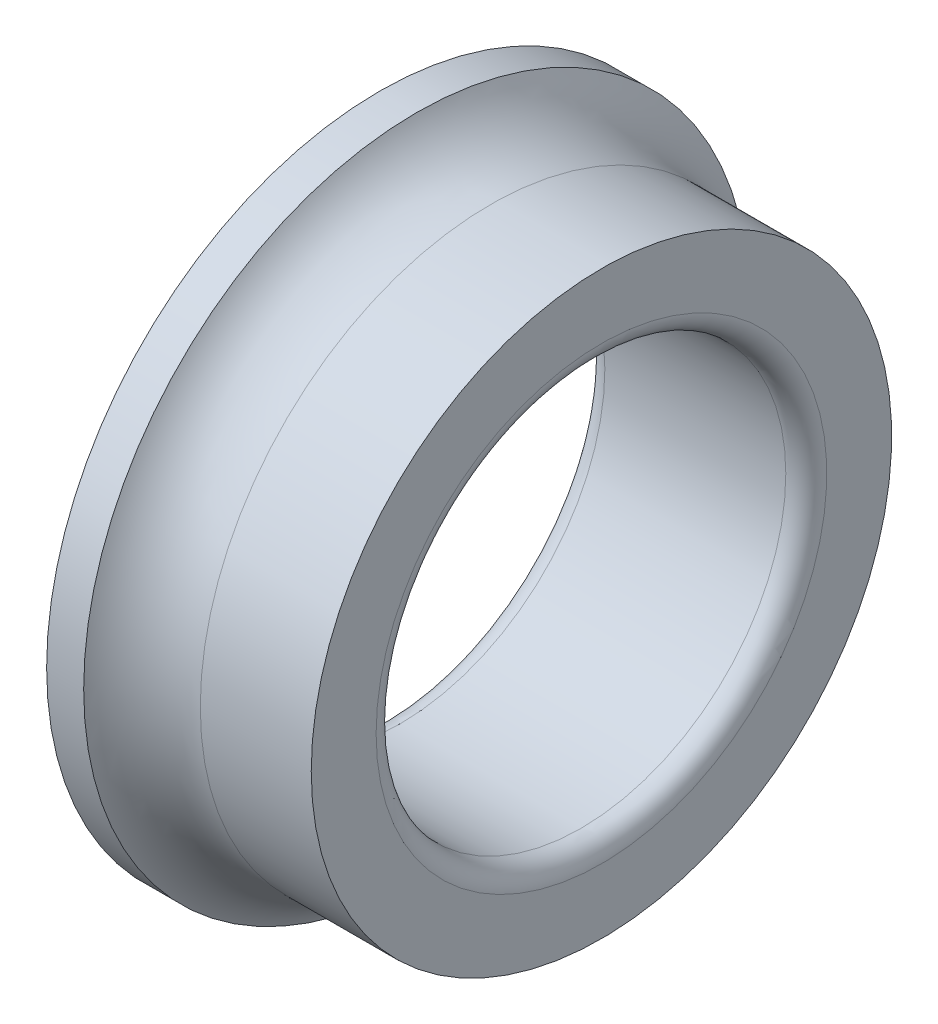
ISO-10303-21;
HEADER;
FILE_DESCRIPTION(('STEP AP214'),'2;1');
FILE_NAME('part.step','',(''),(''),'','','');
FILE_SCHEMA(('AUTOMOTIVE_DESIGN { 1 0 10303 214 1 1 1 1 }'));
ENDSEC;
DATA;
#1=APPLICATION_CONTEXT('core data for automotive mechanical design processes');
#2=APPLICATION_PROTOCOL_DEFINITION('international standard','automotive_design',2000,#1);
#3=PRODUCT_CONTEXT('',#1,'mechanical');
#4=PRODUCT('Part','Part','',(#3));
#5=PRODUCT_RELATED_PRODUCT_CATEGORY('part','',(#4));
#6=PRODUCT_DEFINITION_FORMATION('','',#4);
#7=PRODUCT_DEFINITION_CONTEXT('part definition',#1,'design');
#8=PRODUCT_DEFINITION('design','',#6,#7);
#9=PRODUCT_DEFINITION_SHAPE('','',#8);
#10=(LENGTH_UNIT() NAMED_UNIT(*) SI_UNIT(.MILLI.,.METRE.));
#11=(NAMED_UNIT(*) PLANE_ANGLE_UNIT() SI_UNIT($,.RADIAN.));
#12=(NAMED_UNIT(*) SI_UNIT($,.STERADIAN.) SOLID_ANGLE_UNIT());
#13=UNCERTAINTY_MEASURE_WITH_UNIT(LENGTH_MEASURE(1.E-05),#10,'distance_accuracy_value','');
#14=(GEOMETRIC_REPRESENTATION_CONTEXT(3) GLOBAL_UNCERTAINTY_ASSIGNED_CONTEXT((#13)) GLOBAL_UNIT_ASSIGNED_CONTEXT((#10,
#11,#12)) REPRESENTATION_CONTEXT('',''));
#15=CARTESIAN_POINT('',(0.,0.,0.));
#16=DIRECTION('',(0.,0.,1.));
#17=DIRECTION('',(1.,0.,0.));
#18=AXIS2_PLACEMENT_3D('',#15,#16,#17);
#19=CARTESIAN_POINT('',(5.,0.,0.));
#20=DIRECTION('',(-1.,0.,0.));
#21=DIRECTION('',(0.,0.,1.));
#22=AXIS2_PLACEMENT_3D('',#19,#20,#21);
#23=TOROIDAL_SURFACE('',#22,11.,2.5);
#24=CARTESIAN_POINT('',(2.8349364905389,0.,0.));
#25=DIRECTION('',(-1.,0.,0.));
#26=DIRECTION('',(0.,0.,1.));
#27=AXIS2_PLACEMENT_3D('',#24,#25,#26);
#28=CIRCLE('',#27,9.75);
#29=CARTESIAN_POINT('',(2.8349364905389,0.,9.75));
#30=VERTEX_POINT('',#29);
#31=EDGE_CURVE('E10',#30,#30,#28,.T.);
#32=ORIENTED_EDGE('',*,*,#31,.F.);
#33=EDGE_LOOP('',(#32));
#34=FACE_BOUND('',#33,.T.);
#35=CARTESIAN_POINT('',(5.,0.,0.));
#36=DIRECTION('',(-1.,0.,0.));
#37=DIRECTION('',(0.,0.,1.));
#38=AXIS2_PLACEMENT_3D('',#35,#36,#37);
#39=CIRCLE('',#38,8.5);
#40=CARTESIAN_POINT('',(5.,0.,8.5));
#41=VERTEX_POINT('',#40);
#42=EDGE_CURVE('E57',#41,#41,#39,.T.);
#43=ORIENTED_EDGE('',*,*,#42,.T.);
#44=EDGE_LOOP('',(#43));
#45=FACE_BOUND('',#44,.T.);
#46=ADVANCED_FACE('F29',(#34,#45),#23,.F.);
#47=CARTESIAN_POINT('',(0.,0.,0.));
#48=DIRECTION('',(-1.,0.,0.));
#49=DIRECTION('',(0.,0.,1.));
#50=AXIS2_PLACEMENT_3D('',#47,#48,#49);
#51=CYLINDRICAL_SURFACE('',#50,9.75);
#52=CARTESIAN_POINT('',(1.75,0.,0.));
#53=DIRECTION('',(-1.,0.,0.));
#54=DIRECTION('',(0.,0.,1.));
#55=AXIS2_PLACEMENT_3D('',#52,#53,#54);
#56=CIRCLE('',#55,9.75);
#57=CARTESIAN_POINT('',(1.75,0.,9.75));
#58=VERTEX_POINT('',#57);
#59=EDGE_CURVE('E35',#58,#58,#56,.T.);
#60=ORIENTED_EDGE('',*,*,#59,.F.);
#61=EDGE_LOOP('',(#60));
#62=FACE_BOUND('',#61,.T.);
#63=ORIENTED_EDGE('',*,*,#31,.T.);
#64=EDGE_LOOP('',(#63));
#65=FACE_BOUND('',#64,.T.);
#66=ADVANCED_FACE('F94',(#62,#65),#51,.T.);
#67=CARTESIAN_POINT('',(1.75,0.,-9.75));
#68=DIRECTION('',(1.,0.,0.));
#69=DIRECTION('',(0.,0.,-1.));
#70=AXIS2_PLACEMENT_3D('',#67,#68,#69);
#71=PLANE('',#70);
#72=CARTESIAN_POINT('',(1.75,0.,0.));
#73=DIRECTION('',(-1.,0.,0.));
#74=DIRECTION('',(0.,0.,1.));
#75=AXIS2_PLACEMENT_3D('',#72,#73,#74);
#76=CIRCLE('',#75,6.6);
#77=CARTESIAN_POINT('',(1.75,0.,6.6));
#78=VERTEX_POINT('',#77);
#79=EDGE_CURVE('E39',#78,#78,#76,.T.);
#80=ORIENTED_EDGE('',*,*,#79,.F.);
#81=EDGE_LOOP('',(#80));
#82=FACE_BOUND('',#81,.T.);
#83=ORIENTED_EDGE('',*,*,#59,.T.);
#84=EDGE_LOOP('',(#83));
#85=FACE_BOUND('',#84,.T.);
#86=ADVANCED_FACE('F89',(#82,#85),#71,.F.);
#87=CARTESIAN_POINT('',(2.35,0.,0.));
#88=DIRECTION('',(-1.,0.,0.));
#89=DIRECTION('',(0.,0.,1.));
#90=AXIS2_PLACEMENT_3D('',#87,#88,#89);
#91=TOROIDAL_SURFACE('',#90,6.6,0.6);
#92=CARTESIAN_POINT('',(2.35000000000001,0.,0.));
#93=DIRECTION('',(-1.,0.,0.));
#94=DIRECTION('',(0.,0.,1.));
#95=AXIS2_PLACEMENT_3D('',#92,#93,#94);
#96=CIRCLE('',#95,6.);
#97=CARTESIAN_POINT('',(2.35000000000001,0.,6.));
#98=VERTEX_POINT('',#97);
#99=EDGE_CURVE('E43',#98,#98,#96,.T.);
#100=ORIENTED_EDGE('',*,*,#99,.F.);
#101=EDGE_LOOP('',(#100));
#102=FACE_BOUND('',#101,.T.);
#103=ORIENTED_EDGE('',*,*,#79,.T.);
#104=EDGE_LOOP('',(#103));
#105=FACE_BOUND('',#104,.T.);
#106=ADVANCED_FACE('F83',(#102,#105),#91,.T.);
#107=CARTESIAN_POINT('',(0.,0.,0.));
#108=DIRECTION('',(-1.,0.,0.));
#109=DIRECTION('',(0.,0.,1.));
#110=AXIS2_PLACEMENT_3D('',#107,#108,#109);
#111=CYLINDRICAL_SURFACE('',#110,6.);
#112=CARTESIAN_POINT('',(7.64999999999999,0.,0.));
#113=DIRECTION('',(-1.,0.,0.));
#114=DIRECTION('',(0.,0.,1.));
#115=AXIS2_PLACEMENT_3D('',#112,#113,#114);
#116=CIRCLE('',#115,6.);
#117=CARTESIAN_POINT('',(7.64999999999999,0.,6.));
#118=VERTEX_POINT('',#117);
#119=EDGE_CURVE('E48',#118,#118,#116,.T.);
#120=ORIENTED_EDGE('',*,*,#119,.F.);
#121=EDGE_LOOP('',(#120));
#122=FACE_BOUND('',#121,.T.);
#123=ORIENTED_EDGE('',*,*,#99,.T.);
#124=EDGE_LOOP('',(#123));
#125=FACE_BOUND('',#124,.T.);
#126=ADVANCED_FACE('F77',(#122,#125),#111,.F.);
#127=CARTESIAN_POINT('',(7.65,0.,0.));
#128=DIRECTION('',(-1.,0.,0.));
#129=DIRECTION('',(0.,0.,1.));
#130=AXIS2_PLACEMENT_3D('',#127,#128,#129);
#131=TOROIDAL_SURFACE('',#130,6.6,0.6);
#132=CARTESIAN_POINT('',(8.25,0.,0.));
#133=DIRECTION('',(-1.,0.,0.));
#134=DIRECTION('',(0.,0.,1.));
#135=AXIS2_PLACEMENT_3D('',#132,#133,#134);
#136=CIRCLE('',#135,6.6);
#137=CARTESIAN_POINT('',(8.25,0.,6.6));
#138=VERTEX_POINT('',#137);
#139=EDGE_CURVE('E51',#138,#138,#136,.T.);
#140=ORIENTED_EDGE('',*,*,#139,.F.);
#141=EDGE_LOOP('',(#140));
#142=FACE_BOUND('',#141,.T.);
#143=ORIENTED_EDGE('',*,*,#119,.T.);
#144=EDGE_LOOP('',(#143));
#145=FACE_BOUND('',#144,.T.);
#146=ADVANCED_FACE('F71',(#142,#145),#131,.T.);
#147=CARTESIAN_POINT('',(8.25,0.,-8.5));
#148=DIRECTION('',(-1.,0.,0.));
#149=DIRECTION('',(0.,0.,1.));
#150=AXIS2_PLACEMENT_3D('',#147,#148,#149);
#151=PLANE('',#150);
#152=CARTESIAN_POINT('',(8.25,0.,0.));
#153=DIRECTION('',(-1.,0.,0.));
#154=DIRECTION('',(0.,0.,1.));
#155=AXIS2_PLACEMENT_3D('',#152,#153,#154);
#156=CIRCLE('',#155,8.5);
#157=CARTESIAN_POINT('',(8.25,0.,8.5));
#158=VERTEX_POINT('',#157);
#159=EDGE_CURVE('E54',#158,#158,#156,.T.);
#160=ORIENTED_EDGE('',*,*,#159,.F.);
#161=EDGE_LOOP('',(#160));
#162=FACE_BOUND('',#161,.T.);
#163=ORIENTED_EDGE('',*,*,#139,.T.);
#164=EDGE_LOOP('',(#163));
#165=FACE_BOUND('',#164,.T.);
#166=ADVANCED_FACE('F65',(#162,#165),#151,.F.);
#167=CARTESIAN_POINT('',(0.,0.,0.));
#168=DIRECTION('',(-1.,0.,0.));
#169=DIRECTION('',(0.,0.,1.));
#170=AXIS2_PLACEMENT_3D('',#167,#168,#169);
#171=CYLINDRICAL_SURFACE('',#170,8.5);
#172=ORIENTED_EDGE('',*,*,#42,.F.);
#173=EDGE_LOOP('',(#172));
#174=FACE_BOUND('',#173,.T.);
#175=ORIENTED_EDGE('',*,*,#159,.T.);
#176=EDGE_LOOP('',(#175));
#177=FACE_BOUND('',#176,.T.);
#178=ADVANCED_FACE('F62',(#174,#177),#171,.T.);
#179=CLOSED_SHELL('',(#46,#66,#86,#106,#126,#146,#166,#178));
#180=MANIFOLD_SOLID_BREP('B2',#179);
#181=ADVANCED_BREP_SHAPE_REPRESENTATION('',(#18,#180),#14);
#182=SHAPE_DEFINITION_REPRESENTATION(#9,#181);
ENDSEC;
END-ISO-10303-21;
